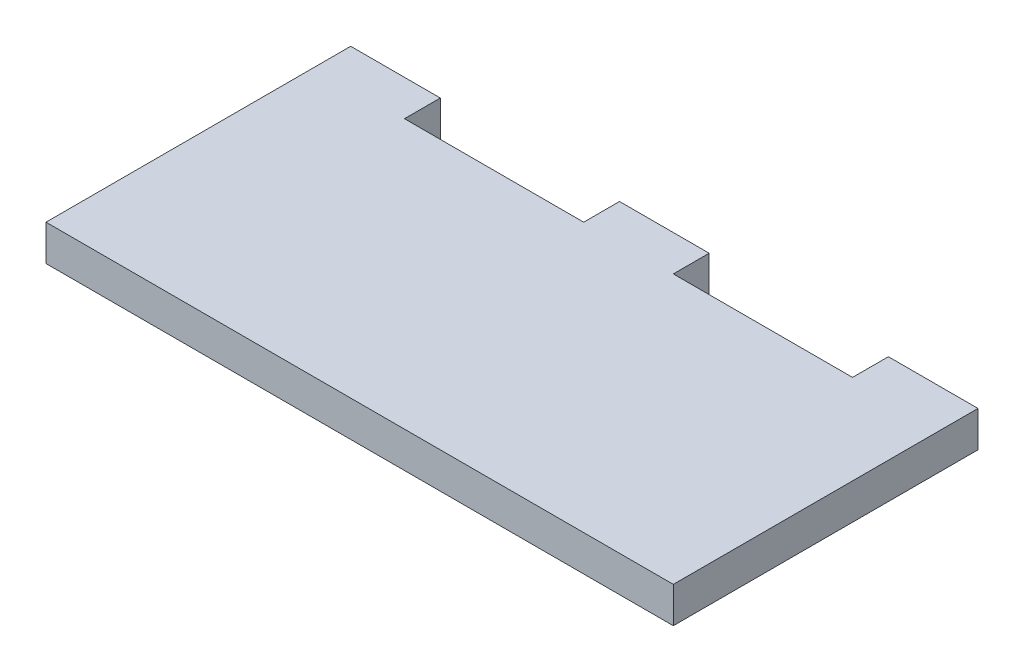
ISO-10303-21;
HEADER;
FILE_DESCRIPTION(('STEP AP214'),'2;1');
FILE_NAME('part.step','',(''),(''),'','','');
FILE_SCHEMA(('AUTOMOTIVE_DESIGN { 1 0 10303 214 1 1 1 1 }'));
ENDSEC;
DATA;
#1=APPLICATION_CONTEXT('core data for automotive mechanical design processes');
#2=APPLICATION_PROTOCOL_DEFINITION('international standard','automotive_design',2000,#1);
#3=PRODUCT_CONTEXT('',#1,'mechanical');
#4=PRODUCT('Part','Part','',(#3));
#5=PRODUCT_RELATED_PRODUCT_CATEGORY('part','',(#4));
#6=PRODUCT_DEFINITION_FORMATION('','',#4);
#7=PRODUCT_DEFINITION_CONTEXT('part definition',#1,'design');
#8=PRODUCT_DEFINITION('design','',#6,#7);
#9=PRODUCT_DEFINITION_SHAPE('','',#8);
#10=(LENGTH_UNIT() NAMED_UNIT(*) SI_UNIT(.MILLI.,.METRE.));
#11=(NAMED_UNIT(*) PLANE_ANGLE_UNIT() SI_UNIT($,.RADIAN.));
#12=(NAMED_UNIT(*) SI_UNIT($,.STERADIAN.) SOLID_ANGLE_UNIT());
#13=UNCERTAINTY_MEASURE_WITH_UNIT(LENGTH_MEASURE(1.E-05),#10,'distance_accuracy_value','');
#14=(GEOMETRIC_REPRESENTATION_CONTEXT(3) GLOBAL_UNCERTAINTY_ASSIGNED_CONTEXT((#13)) GLOBAL_UNIT_ASSIGNED_CONTEXT((#10,
#11,#12)) REPRESENTATION_CONTEXT('',''));
#15=CARTESIAN_POINT('',(0.,0.,0.));
#16=DIRECTION('',(0.,0.,1.));
#17=DIRECTION('',(1.,0.,0.));
#18=AXIS2_PLACEMENT_3D('',#15,#16,#17);
#19=CARTESIAN_POINT('',(0.,0.,-2.));
#20=DIRECTION('',(0.,1.,0.));
#21=DIRECTION('',(0.,0.,1.));
#22=AXIS2_PLACEMENT_3D('',#19,#20,#21);
#23=PLANE('',#22);
#24=DIRECTION('',(0.,0.,1.));
#25=VECTOR('',#24,1.);
#26=CARTESIAN_POINT('',(0.,0.,-2.));
#27=LINE('',#26,#25);
#28=CARTESIAN_POINT('',(0.,0.,-2.));
#29=VERTEX_POINT('',#28);
#30=CARTESIAN_POINT('',(0.,0.,15.));
#31=VERTEX_POINT('',#30);
#32=EDGE_CURVE('E11',#29,#31,#27,.T.);
#33=ORIENTED_EDGE('',*,*,#32,.T.);
#34=DIRECTION('',(-1.,0.,0.));
#35=VECTOR('',#34,1.);
#36=CARTESIAN_POINT('',(0.,0.,15.));
#37=LINE('',#36,#35);
#38=CARTESIAN_POINT('',(35.,0.,15.));
#39=VERTEX_POINT('',#38);
#40=EDGE_CURVE('E187',#39,#31,#37,.T.);
#41=ORIENTED_EDGE('',*,*,#40,.F.);
#42=DIRECTION('',(0.,0.,1.));
#43=VECTOR('',#42,1.);
#44=CARTESIAN_POINT('',(35.,0.,-2.));
#45=LINE('',#44,#43);
#46=CARTESIAN_POINT('',(35.,0.,-2.));
#47=VERTEX_POINT('',#46);
#48=EDGE_CURVE('E42',#47,#39,#45,.T.);
#49=ORIENTED_EDGE('',*,*,#48,.F.);
#50=DIRECTION('',(-1.,0.,0.));
#51=VECTOR('',#50,1.);
#52=CARTESIAN_POINT('',(0.,0.,-2.));
#53=LINE('',#52,#51);
#54=CARTESIAN_POINT('',(30.,0.,-2.));
#55=VERTEX_POINT('',#54);
#56=EDGE_CURVE('E163',#47,#55,#53,.T.);
#57=ORIENTED_EDGE('',*,*,#56,.T.);
#58=DIRECTION('',(0.,0.,1.));
#59=VECTOR('',#58,1.);
#60=CARTESIAN_POINT('',(30.,0.,0.));
#61=LINE('',#60,#59);
#62=CARTESIAN_POINT('',(30.,0.,0.));
#63=VERTEX_POINT('',#62);
#64=EDGE_CURVE('E58',#55,#63,#61,.T.);
#65=ORIENTED_EDGE('',*,*,#64,.T.);
#66=DIRECTION('',(-1.,0.,0.));
#67=VECTOR('',#66,1.);
#68=CARTESIAN_POINT('',(0.,0.,0.));
#69=LINE('',#68,#67);
#70=CARTESIAN_POINT('',(20.,0.,0.));
#71=VERTEX_POINT('',#70);
#72=EDGE_CURVE('E188',#63,#71,#69,.T.);
#73=ORIENTED_EDGE('',*,*,#72,.T.);
#74=DIRECTION('',(0.,0.,-1.));
#75=VECTOR('',#74,1.);
#76=CARTESIAN_POINT('',(20.,0.,0.));
#77=LINE('',#76,#75);
#78=CARTESIAN_POINT('',(20.,0.,-2.));
#79=VERTEX_POINT('',#78);
#80=EDGE_CURVE('E226',#71,#79,#77,.T.);
#81=ORIENTED_EDGE('',*,*,#80,.T.);
#82=CARTESIAN_POINT('',(15.,0.,-2.));
#83=VERTEX_POINT('',#82);
#84=EDGE_CURVE('E143',#79,#83,#53,.T.);
#85=ORIENTED_EDGE('',*,*,#84,.T.);
#86=DIRECTION('',(0.,0.,1.));
#87=VECTOR('',#86,1.);
#88=CARTESIAN_POINT('',(15.,0.,0.));
#89=LINE('',#88,#87);
#90=CARTESIAN_POINT('',(15.,0.,0.));
#91=VERTEX_POINT('',#90);
#92=EDGE_CURVE('E50',#83,#91,#89,.T.);
#93=ORIENTED_EDGE('',*,*,#92,.T.);
#94=CARTESIAN_POINT('',(5.,0.,0.));
#95=VERTEX_POINT('',#94);
#96=EDGE_CURVE('E191',#91,#95,#69,.T.);
#97=ORIENTED_EDGE('',*,*,#96,.T.);
#98=DIRECTION('',(0.,0.,-1.));
#99=VECTOR('',#98,1.);
#100=CARTESIAN_POINT('',(5.,0.,0.));
#101=LINE('',#100,#99);
#102=CARTESIAN_POINT('',(5.,0.,-2.));
#103=VERTEX_POINT('',#102);
#104=EDGE_CURVE('E144',#95,#103,#101,.T.);
#105=ORIENTED_EDGE('',*,*,#104,.T.);
#106=EDGE_CURVE('E162',#103,#29,#53,.T.);
#107=ORIENTED_EDGE('',*,*,#106,.T.);
#108=EDGE_LOOP('',(#33,#41,#49,#57,#65,#73,#81,#85,#93,#97,#105,#107));
#109=FACE_BOUND('',#108,.T.);
#110=ADVANCED_FACE('F33',(#109),#23,.T.);
#111=CARTESIAN_POINT('',(0.,-2.,-2.));
#112=DIRECTION('',(0.,-1.,0.));
#113=DIRECTION('',(0.,0.,-1.));
#114=AXIS2_PLACEMENT_3D('',#111,#112,#113);
#115=PLANE('',#114);
#116=DIRECTION('',(1.,0.,0.));
#117=VECTOR('',#116,1.);
#118=CARTESIAN_POINT('',(0.,-2.,-2.));
#119=LINE('',#118,#117);
#120=CARTESIAN_POINT('',(0.,-2.,-2.));
#121=VERTEX_POINT('',#120);
#122=CARTESIAN_POINT('',(5.,-2.,-2.));
#123=VERTEX_POINT('',#122);
#124=EDGE_CURVE('E152',#121,#123,#119,.T.);
#125=ORIENTED_EDGE('',*,*,#124,.T.);
#126=DIRECTION('',(0.,0.,-1.));
#127=VECTOR('',#126,1.);
#128=CARTESIAN_POINT('',(5.,-2.,0.));
#129=LINE('',#128,#127);
#130=CARTESIAN_POINT('',(5.,-2.,0.));
#131=VERTEX_POINT('',#130);
#132=EDGE_CURVE('E204',#131,#123,#129,.T.);
#133=ORIENTED_EDGE('',*,*,#132,.F.);
#134=DIRECTION('',(-1.,0.,0.));
#135=VECTOR('',#134,1.);
#136=CARTESIAN_POINT('',(5.,-2.,0.));
#137=LINE('',#136,#135);
#138=CARTESIAN_POINT('',(15.,-2.,0.));
#139=VERTEX_POINT('',#138);
#140=EDGE_CURVE('E205',#139,#131,#137,.T.);
#141=ORIENTED_EDGE('',*,*,#140,.F.);
#142=DIRECTION('',(0.,0.,1.));
#143=VECTOR('',#142,1.);
#144=CARTESIAN_POINT('',(15.,-2.,0.));
#145=LINE('',#144,#143);
#146=CARTESIAN_POINT('',(15.,-2.,-2.));
#147=VERTEX_POINT('',#146);
#148=EDGE_CURVE('E151',#147,#139,#145,.T.);
#149=ORIENTED_EDGE('',*,*,#148,.F.);
#150=CARTESIAN_POINT('',(20.,-2.,-2.));
#151=VERTEX_POINT('',#150);
#152=EDGE_CURVE('E141',#147,#151,#119,.T.);
#153=ORIENTED_EDGE('',*,*,#152,.T.);
#154=DIRECTION('',(0.,0.,-1.));
#155=VECTOR('',#154,1.);
#156=CARTESIAN_POINT('',(20.,-2.,0.));
#157=LINE('',#156,#155);
#158=CARTESIAN_POINT('',(20.,-2.,0.));
#159=VERTEX_POINT('',#158);
#160=EDGE_CURVE('E125',#159,#151,#157,.T.);
#161=ORIENTED_EDGE('',*,*,#160,.F.);
#162=DIRECTION('',(-1.,0.,0.));
#163=VECTOR('',#162,1.);
#164=CARTESIAN_POINT('',(20.,-2.,0.));
#165=LINE('',#164,#163);
#166=CARTESIAN_POINT('',(30.,-2.,0.));
#167=VERTEX_POINT('',#166);
#168=EDGE_CURVE('E230',#167,#159,#165,.T.);
#169=ORIENTED_EDGE('',*,*,#168,.F.);
#170=DIRECTION('',(0.,0.,1.));
#171=VECTOR('',#170,1.);
#172=CARTESIAN_POINT('',(30.,-2.,0.));
#173=LINE('',#172,#171);
#174=CARTESIAN_POINT('',(30.,-2.,-2.));
#175=VERTEX_POINT('',#174);
#176=EDGE_CURVE('E135',#175,#167,#173,.T.);
#177=ORIENTED_EDGE('',*,*,#176,.F.);
#178=CARTESIAN_POINT('',(35.,-2.,-2.));
#179=VERTEX_POINT('',#178);
#180=EDGE_CURVE('E153',#175,#179,#119,.T.);
#181=ORIENTED_EDGE('',*,*,#180,.T.);
#182=DIRECTION('',(0.,0.,1.));
#183=VECTOR('',#182,1.);
#184=CARTESIAN_POINT('',(35.,-2.,-2.));
#185=LINE('',#184,#183);
#186=CARTESIAN_POINT('',(35.,-2.,15.));
#187=VERTEX_POINT('',#186);
#188=EDGE_CURVE('E166',#179,#187,#185,.T.);
#189=ORIENTED_EDGE('',*,*,#188,.T.);
#190=DIRECTION('',(1.,0.,0.));
#191=VECTOR('',#190,1.);
#192=CARTESIAN_POINT('',(0.,-2.,15.));
#193=LINE('',#192,#191);
#194=CARTESIAN_POINT('',(0.,-2.,15.));
#195=VERTEX_POINT('',#194);
#196=EDGE_CURVE('E178',#195,#187,#193,.T.);
#197=ORIENTED_EDGE('',*,*,#196,.F.);
#198=DIRECTION('',(0.,0.,1.));
#199=VECTOR('',#198,1.);
#200=CARTESIAN_POINT('',(0.,-2.,-2.));
#201=LINE('',#200,#199);
#202=EDGE_CURVE('E37',#121,#195,#201,.T.);
#203=ORIENTED_EDGE('',*,*,#202,.F.);
#204=EDGE_LOOP('',(#125,#133,#141,#149,#153,#161,#169,#177,#181,#189,#197,#203));
#205=FACE_BOUND('',#204,.T.);
#206=ADVANCED_FACE('F149',(#205),#115,.T.);
#207=CARTESIAN_POINT('',(0.,0.,-2.));
#208=DIRECTION('',(0.,0.,1.));
#209=DIRECTION('',(1.,0.,0.));
#210=AXIS2_PLACEMENT_3D('',#207,#208,#209);
#211=PLANE('',#210);
#212=DIRECTION('',(0.,1.,0.));
#213=VECTOR('',#212,1.);
#214=CARTESIAN_POINT('',(5.,-2.,-2.));
#215=LINE('',#214,#213);
#216=EDGE_CURVE('E202',#123,#103,#215,.T.);
#217=ORIENTED_EDGE('',*,*,#216,.F.);
#218=ORIENTED_EDGE('',*,*,#124,.F.);
#219=DIRECTION('',(0.,-1.,0.));
#220=VECTOR('',#219,1.);
#221=CARTESIAN_POINT('',(0.,0.,-2.));
#222=LINE('',#221,#220);
#223=EDGE_CURVE('E156',#29,#121,#222,.T.);
#224=ORIENTED_EDGE('',*,*,#223,.F.);
#225=ORIENTED_EDGE('',*,*,#106,.F.);
#226=EDGE_LOOP('',(#217,#218,#224,#225));
#227=FACE_BOUND('',#226,.T.);
#228=ADVANCED_FACE('F201',(#227),#211,.F.);
#229=DIRECTION('',(0.,1.,0.));
#230=VECTOR('',#229,1.);
#231=CARTESIAN_POINT('',(15.,-2.,-2.));
#232=LINE('',#231,#230);
#233=EDGE_CURVE('E220',#147,#83,#232,.T.);
#234=ORIENTED_EDGE('',*,*,#233,.T.);
#235=ORIENTED_EDGE('',*,*,#84,.F.);
#236=DIRECTION('',(0.,1.,0.));
#237=VECTOR('',#236,1.);
#238=CARTESIAN_POINT('',(20.,-2.,-2.));
#239=LINE('',#238,#237);
#240=EDGE_CURVE('E128',#151,#79,#239,.T.);
#241=ORIENTED_EDGE('',*,*,#240,.F.);
#242=ORIENTED_EDGE('',*,*,#152,.F.);
#243=EDGE_LOOP('',(#234,#235,#241,#242));
#244=FACE_BOUND('',#243,.T.);
#245=ADVANCED_FACE('F140',(#244),#211,.F.);
#246=DIRECTION('',(0.,1.,0.));
#247=VECTOR('',#246,1.);
#248=CARTESIAN_POINT('',(30.,-2.,-2.));
#249=LINE('',#248,#247);
#250=EDGE_CURVE('E145',#175,#55,#249,.T.);
#251=ORIENTED_EDGE('',*,*,#250,.T.);
#252=ORIENTED_EDGE('',*,*,#56,.F.);
#253=DIRECTION('',(0.,1.,0.));
#254=VECTOR('',#253,1.);
#255=CARTESIAN_POINT('',(35.,0.,-2.));
#256=LINE('',#255,#254);
#257=EDGE_CURVE('E155',#179,#47,#256,.T.);
#258=ORIENTED_EDGE('',*,*,#257,.F.);
#259=ORIENTED_EDGE('',*,*,#180,.F.);
#260=EDGE_LOOP('',(#251,#252,#258,#259));
#261=FACE_BOUND('',#260,.T.);
#262=ADVANCED_FACE('F238',(#261),#211,.F.);
#263=CARTESIAN_POINT('',(0.,0.,-2.));
#264=DIRECTION('',(-1.,0.,0.));
#265=DIRECTION('',(0.,-1.,0.));
#266=AXIS2_PLACEMENT_3D('',#263,#264,#265);
#267=PLANE('',#266);
#268=ORIENTED_EDGE('',*,*,#202,.T.);
#269=DIRECTION('',(0.,-1.,0.));
#270=VECTOR('',#269,1.);
#271=CARTESIAN_POINT('',(0.,0.,15.));
#272=LINE('',#271,#270);
#273=EDGE_CURVE('E175',#31,#195,#272,.T.);
#274=ORIENTED_EDGE('',*,*,#273,.F.);
#275=ORIENTED_EDGE('',*,*,#32,.F.);
#276=ORIENTED_EDGE('',*,*,#223,.T.);
#277=EDGE_LOOP('',(#268,#274,#275,#276));
#278=FACE_BOUND('',#277,.T.);
#279=ADVANCED_FACE('F35',(#278),#267,.T.);
#280=CARTESIAN_POINT('',(35.,0.,-2.));
#281=DIRECTION('',(1.,0.,0.));
#282=DIRECTION('',(0.,0.,-1.));
#283=AXIS2_PLACEMENT_3D('',#280,#281,#282);
#284=PLANE('',#283);
#285=ORIENTED_EDGE('',*,*,#48,.T.);
#286=DIRECTION('',(0.,1.,0.));
#287=VECTOR('',#286,1.);
#288=CARTESIAN_POINT('',(35.,0.,15.));
#289=LINE('',#288,#287);
#290=EDGE_CURVE('E182',#187,#39,#289,.T.);
#291=ORIENTED_EDGE('',*,*,#290,.F.);
#292=ORIENTED_EDGE('',*,*,#188,.F.);
#293=ORIENTED_EDGE('',*,*,#257,.T.);
#294=EDGE_LOOP('',(#285,#291,#292,#293));
#295=FACE_BOUND('',#294,.T.);
#296=ADVANCED_FACE('F263',(#295),#284,.T.);
#297=CARTESIAN_POINT('',(0.,0.,15.));
#298=DIRECTION('',(0.,0.,1.));
#299=DIRECTION('',(1.,0.,0.));
#300=AXIS2_PLACEMENT_3D('',#297,#298,#299);
#301=PLANE('',#300);
#302=ORIENTED_EDGE('',*,*,#273,.T.);
#303=ORIENTED_EDGE('',*,*,#196,.T.);
#304=ORIENTED_EDGE('',*,*,#290,.T.);
#305=ORIENTED_EDGE('',*,*,#40,.T.);
#306=EDGE_LOOP('',(#302,#303,#304,#305));
#307=FACE_BOUND('',#306,.T.);
#308=ADVANCED_FACE('F185',(#307),#301,.T.);
#309=CARTESIAN_POINT('',(20.,-2.,0.));
#310=DIRECTION('',(1.,0.,0.));
#311=DIRECTION('',(0.,1.,0.));
#312=AXIS2_PLACEMENT_3D('',#309,#310,#311);
#313=PLANE('',#312);
#314=ORIENTED_EDGE('',*,*,#80,.F.);
#315=DIRECTION('',(0.,1.,0.));
#316=VECTOR('',#315,1.);
#317=CARTESIAN_POINT('',(20.,-2.,0.));
#318=LINE('',#317,#316);
#319=EDGE_CURVE('E131',#159,#71,#318,.T.);
#320=ORIENTED_EDGE('',*,*,#319,.F.);
#321=ORIENTED_EDGE('',*,*,#160,.T.);
#322=ORIENTED_EDGE('',*,*,#240,.T.);
#323=EDGE_LOOP('',(#314,#320,#321,#322));
#324=FACE_BOUND('',#323,.T.);
#325=ADVANCED_FACE('F127',(#324),#313,.T.);
#326=CARTESIAN_POINT('',(30.,-2.,0.));
#327=DIRECTION('',(-1.,0.,0.));
#328=DIRECTION('',(0.,-1.,0.));
#329=AXIS2_PLACEMENT_3D('',#326,#327,#328);
#330=PLANE('',#329);
#331=ORIENTED_EDGE('',*,*,#64,.F.);
#332=ORIENTED_EDGE('',*,*,#250,.F.);
#333=ORIENTED_EDGE('',*,*,#176,.T.);
#334=DIRECTION('',(0.,1.,0.));
#335=VECTOR('',#334,1.);
#336=CARTESIAN_POINT('',(30.,-2.,0.));
#337=LINE('',#336,#335);
#338=EDGE_CURVE('E234',#167,#63,#337,.T.);
#339=ORIENTED_EDGE('',*,*,#338,.T.);
#340=EDGE_LOOP('',(#331,#332,#333,#339));
#341=FACE_BOUND('',#340,.T.);
#342=ADVANCED_FACE('F241',(#341),#330,.T.);
#343=CARTESIAN_POINT('',(0.,0.,0.));
#344=DIRECTION('',(0.,0.,-1.));
#345=DIRECTION('',(0.,1.,0.));
#346=AXIS2_PLACEMENT_3D('',#343,#344,#345);
#347=PLANE('',#346);
#348=ORIENTED_EDGE('',*,*,#338,.F.);
#349=ORIENTED_EDGE('',*,*,#168,.T.);
#350=ORIENTED_EDGE('',*,*,#319,.T.);
#351=ORIENTED_EDGE('',*,*,#72,.F.);
#352=EDGE_LOOP('',(#348,#349,#350,#351));
#353=FACE_BOUND('',#352,.T.);
#354=ADVANCED_FACE('F244',(#353),#347,.T.);
#355=DIRECTION('',(0.,1.,0.));
#356=VECTOR('',#355,1.);
#357=CARTESIAN_POINT('',(15.,-2.,0.));
#358=LINE('',#357,#356);
#359=EDGE_CURVE('E218',#139,#91,#358,.T.);
#360=ORIENTED_EDGE('',*,*,#359,.F.);
#361=ORIENTED_EDGE('',*,*,#140,.T.);
#362=DIRECTION('',(0.,1.,0.));
#363=VECTOR('',#362,1.);
#364=CARTESIAN_POINT('',(5.,-2.,0.));
#365=LINE('',#364,#363);
#366=EDGE_CURVE('E214',#131,#95,#365,.T.);
#367=ORIENTED_EDGE('',*,*,#366,.T.);
#368=ORIENTED_EDGE('',*,*,#96,.F.);
#369=EDGE_LOOP('',(#360,#361,#367,#368));
#370=FACE_BOUND('',#369,.T.);
#371=ADVANCED_FACE('F224',(#370),#347,.T.);
#372=CARTESIAN_POINT('',(5.,-2.,0.));
#373=DIRECTION('',(1.,0.,0.));
#374=DIRECTION('',(0.,1.,0.));
#375=AXIS2_PLACEMENT_3D('',#372,#373,#374);
#376=PLANE('',#375);
#377=ORIENTED_EDGE('',*,*,#104,.F.);
#378=ORIENTED_EDGE('',*,*,#366,.F.);
#379=ORIENTED_EDGE('',*,*,#132,.T.);
#380=ORIENTED_EDGE('',*,*,#216,.T.);
#381=EDGE_LOOP('',(#377,#378,#379,#380));
#382=FACE_BOUND('',#381,.T.);
#383=ADVANCED_FACE('F251',(#382),#376,.T.);
#384=CARTESIAN_POINT('',(15.,-2.,0.));
#385=DIRECTION('',(-1.,0.,0.));
#386=DIRECTION('',(0.,-1.,0.));
#387=AXIS2_PLACEMENT_3D('',#384,#385,#386);
#388=PLANE('',#387);
#389=ORIENTED_EDGE('',*,*,#92,.F.);
#390=ORIENTED_EDGE('',*,*,#233,.F.);
#391=ORIENTED_EDGE('',*,*,#148,.T.);
#392=ORIENTED_EDGE('',*,*,#359,.T.);
#393=EDGE_LOOP('',(#389,#390,#391,#392));
#394=FACE_BOUND('',#393,.T.);
#395=ADVANCED_FACE('F225',(#394),#388,.T.);
#396=CLOSED_SHELL('',(#110,#206,#228,#245,#262,#279,#296,#308,#325,#342,#354,#371,#383,#395));
#397=MANIFOLD_SOLID_BREP('B2',#396);
#398=ADVANCED_BREP_SHAPE_REPRESENTATION('',(#18,#397),#14);
#399=SHAPE_DEFINITION_REPRESENTATION(#9,#398);
ENDSEC;
END-ISO-10303-21;
